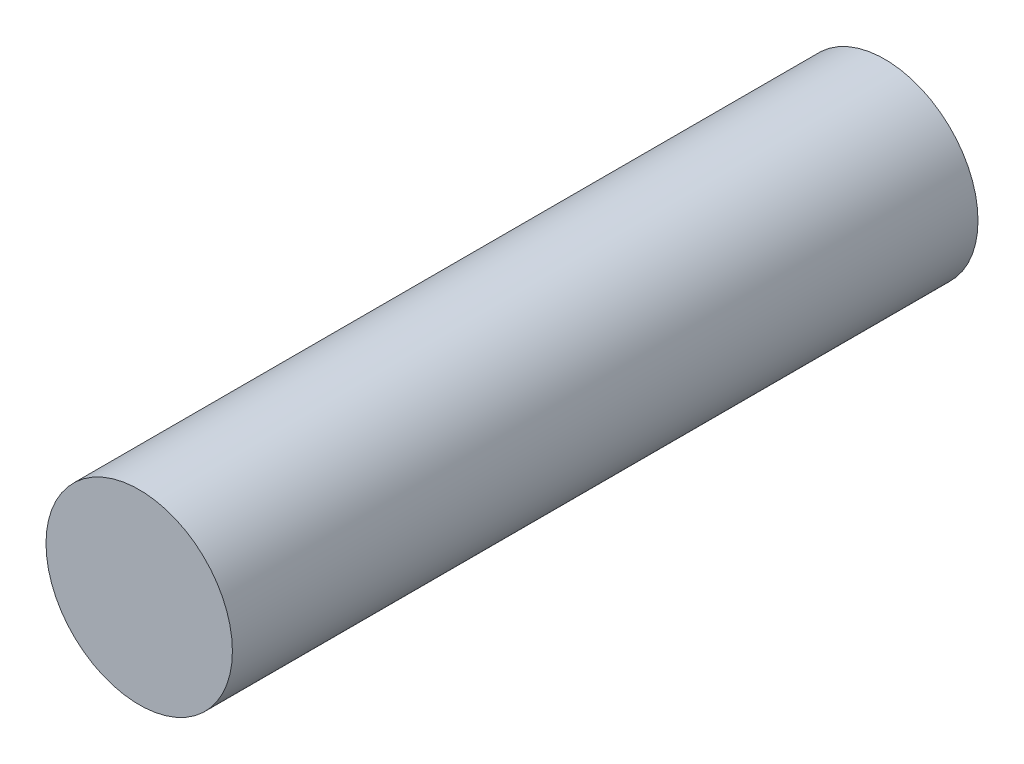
from build123d import *

# Parameters (mm, degrees)
ESQUISSE1_R      = 12.5
EXTRUSION1_DEPTH = 100


with BuildPart() as part:
    # Esquisse1 → Extrusion1 (new body)
    with BuildSketch(Plane.XY):
        Circle(ESQUISSE1_R)
    extrude(amount=EXTRUSION1_DEPTH)


solid = part.part
